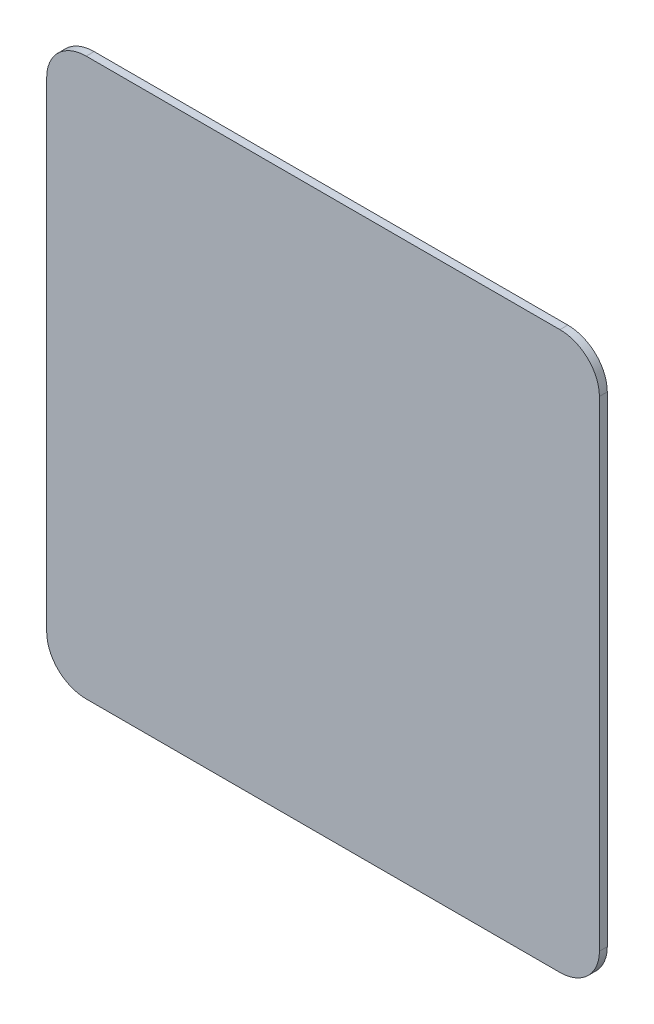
from build123d import *

# Parameters (mm, degrees)
BOSS_EXTRUDE1_DEPTH = 10


with BuildPart() as part:
    # Sketch1 → Boss-Extrude1 (new body)
    with BuildSketch(Plane.XY):
        with BuildLine():
            Line((350, -287.189557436), (350, 321.343713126))
            add(Edge.make_bspline(
                [(350, 321.343713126), (350, 369.640004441), (300, 369.640004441)],
                knots=[0, 0, 0, 1.570796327, 1.570796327, 1.570796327], degree=2, weights=[1, 0.707106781, 1]))
            Line((300, 369.640004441), (-300, 369.640004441))
            add(Edge.make_bspline(
                [(-300, 369.640004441), (-350, 369.640004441), (-350, 321.343713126)],
                knots=[1.570796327, 1.570796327, 1.570796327, 3.141592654, 3.141592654, 3.141592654], degree=2, weights=[1, 0.707106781, 1]))
            Line((-350, 321.343713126), (-350, -287.189557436))
            add(Edge.make_bspline(
                [(-350, -287.189557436), (-350, -335.48584875), (-300, -335.48584875)],
                knots=[3.141592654, 3.141592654, 3.141592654, 4.71238898, 4.71238898, 4.71238898], degree=2, weights=[1, 0.707106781, 1]))
            Line((-300, -335.48584875), (300, -335.48584875))
            add(Edge.make_bspline(
                [(300, -335.48584875), (350, -335.48584875), (350, -287.189557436)],
                knots=[4.71238898, 4.71238898, 4.71238898, 6.283185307, 6.283185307, 6.283185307], degree=2, weights=[1, 0.707106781, 1]))
        make_face()
    extrude(amount=-BOSS_EXTRUDE1_DEPTH)


solid = part.part
